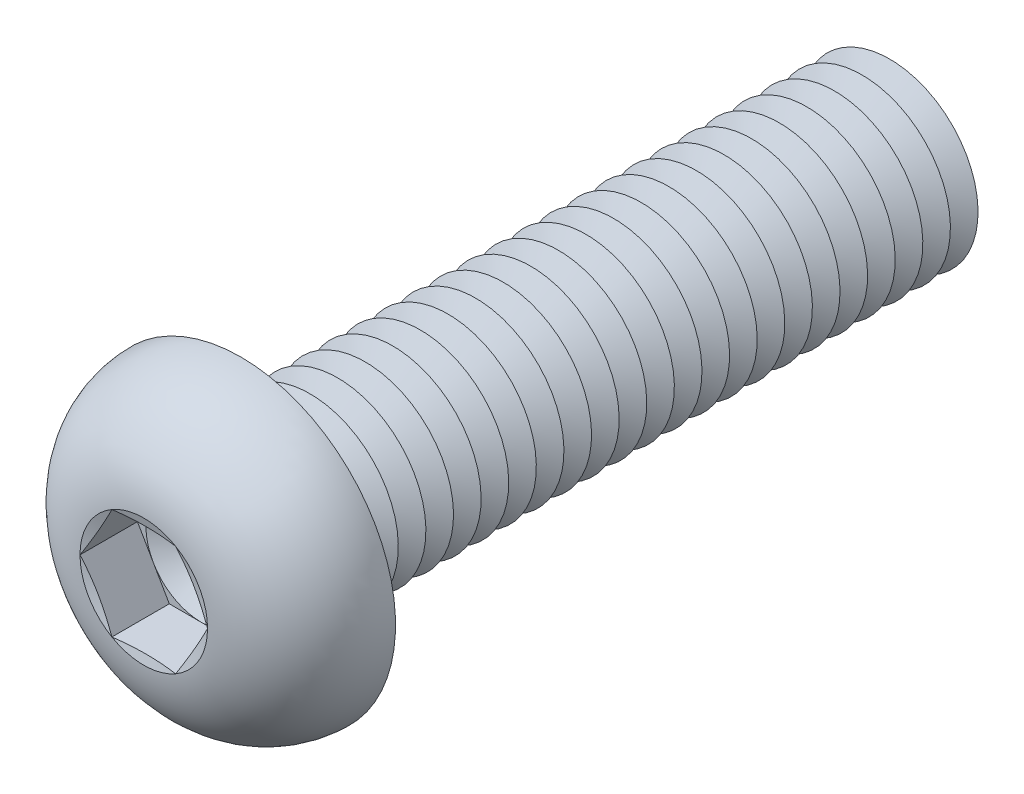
from build123d import *

# Parameters (mm, degrees)
FILLET1_R          = 0.625
LPATTERN1_COUNT    = 24
LPATTERN1_PITCH    = 1.25
CUT_EXTRUDE1_DEPTH = 2.6


with BuildPart() as part:
    # Sketch1 → Revolve1 (revolve)
    with BuildSketch(Plane(origin=(0, 0, 0), x_dir=(0, 0, -1), z_dir=(1, 0, 0))):
        with BuildLine():
            Line((0, 4), (0, 7))
            ThreePointArc((0, 7), (-3.011595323, 5.81154966), (-4.4, 2.88675))
            Line((-4.4, 2.88675), (-4.013248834, 1.443375))
            Line((-4.013248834, 1.443375), (-4.4, 1.443375))
            Line((-4.4, 1.443375), (-4.4, 0))
            Line((-4.4, 0), (30, 0))
            Line((30, 0), (30, 4))
            Line((30, 4), (0, 4))
        make_face()
    revolve(axis=Axis((0, 0, -30), (0, 0, 1)))

    # Fillet1
    fillet1_edges = [part.edges().sort_by_distance(p)[0] for p in [
        (0, -4, 0),
    ]]
    fillet(fillet1_edges, radius=FILLET1_R)

    # Sketch2 → Cut-Revolve1 (revolve, cut)
    with BuildSketch(Plane(origin=(0, 0, 0), x_dir=(0, 0, -1), z_dir=(1, 0, 0))):
        Polygon((29.375, 4), (30.625, 4), (30, 2.917468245), align=None)
    cut_revolve1 = revolve(axis=Axis((0, 0, -30), (0, 0, -1)), mode=Mode.SUBTRACT)

    # LPattern1: Cut-Revolve1 ×24
    with Locations(*[(0, 0, i * LPATTERN1_PITCH) for i in range(1, LPATTERN1_COUNT)]):
        add(cut_revolve1, mode=Mode.SUBTRACT)

    # Sketch3 → Cut-Extrude1 (cut)
    with BuildSketch(Plane.XY.offset(4.4)):
        Polygon((1.443375, 2.499998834), (-1.443375, 2.499998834), (-2.88675, 0), (-1.443375, -2.499998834), (1.443375, -2.499998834), (2.88675, 0), align=None)
    extrude(amount=-CUT_EXTRUDE1_DEPTH, mode=Mode.SUBTRACT)

    # Cut-Extrude2 cone 1 section (on through the dimple's axis) → Cut-Extrude2 (revolve, cut)
    with BuildSketch(Plane(origin=(0, 0, 1.8), x_dir=(0, -1, 0), z_dir=(1, 0, 0))):
        Polygon((0, 0), (2.499998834, 0), (0, 1.443375), align=None)
    revolve(axis=Axis((0, 0, 1.8), (0, 0, -1)), mode=Mode.SUBTRACT)


solid = part.part
